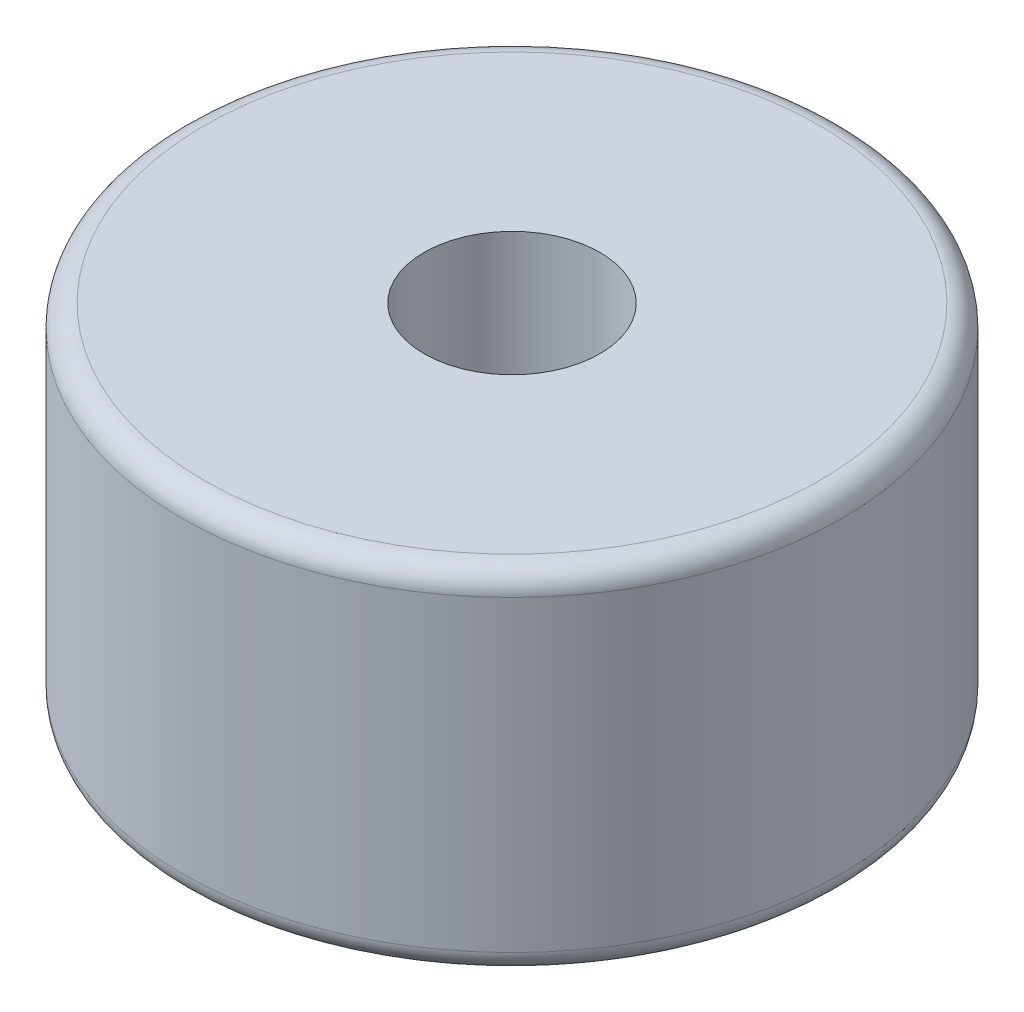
from build123d import *

# Parameters (mm, degrees)
SKETCH1_R           = 7.5
SKETCH1_R_2         = 2
BOSS_EXTRUDE1_DEPTH = 8
FILLET1_R           = 0.5


with BuildPart() as part:
    # Sketch1 → Boss-Extrude1 (new body)
    with BuildSketch(Plane(origin=(0, 0, 0), x_dir=(1, 0, 0), z_dir=(0, 1, 0))):
        with Locations(Location((0, 0, 0), (0, 0, 270))):
            Circle(SKETCH1_R)
        with Locations(Location((0, 0, 0), (0, 0, 270))):
            Circle(SKETCH1_R_2, mode=Mode.SUBTRACT)
    extrude(amount=BOSS_EXTRUDE1_DEPTH)

    # Fillet1
    fillet1_edges = [part.edges().sort_by_distance(p)[0] for p in [
        (0, 0, -7.5),
        (0, 8, -7.5),
    ]]
    fillet(fillet1_edges, radius=FILLET1_R)


solid = part.part
